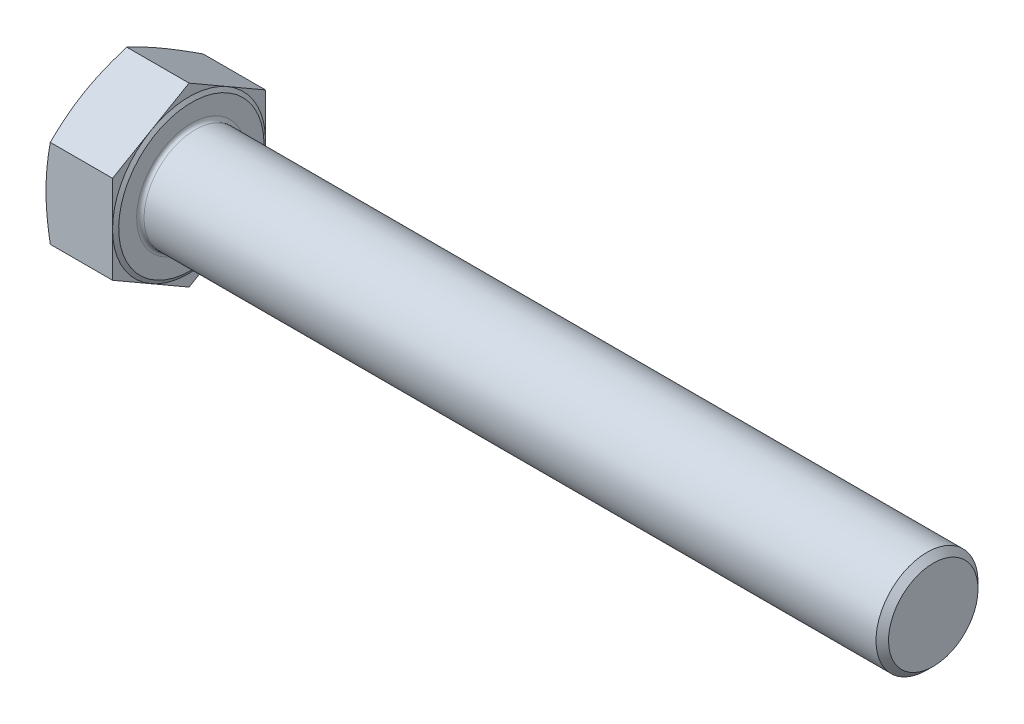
ISO-10303-21;
HEADER;
FILE_DESCRIPTION(('STEP AP214'),'2;1');
FILE_NAME('part.step','',(''),(''),'','','');
FILE_SCHEMA(('AUTOMOTIVE_DESIGN { 1 0 10303 214 1 1 1 1 }'));
ENDSEC;
DATA;
#1=APPLICATION_CONTEXT('core data for automotive mechanical design processes');
#2=APPLICATION_PROTOCOL_DEFINITION('international standard','automotive_design',2000,#1);
#3=PRODUCT_CONTEXT('',#1,'mechanical');
#4=PRODUCT('Part','Part','',(#3));
#5=PRODUCT_RELATED_PRODUCT_CATEGORY('part','',(#4));
#6=PRODUCT_DEFINITION_FORMATION('','',#4);
#7=PRODUCT_DEFINITION_CONTEXT('part definition',#1,'design');
#8=PRODUCT_DEFINITION('design','',#6,#7);
#9=PRODUCT_DEFINITION_SHAPE('','',#8);
#10=(LENGTH_UNIT() NAMED_UNIT(*) SI_UNIT(.MILLI.,.METRE.));
#11=(NAMED_UNIT(*) PLANE_ANGLE_UNIT() SI_UNIT($,.RADIAN.));
#12=(NAMED_UNIT(*) SI_UNIT($,.STERADIAN.) SOLID_ANGLE_UNIT());
#13=UNCERTAINTY_MEASURE_WITH_UNIT(LENGTH_MEASURE(1.E-05),#10,'distance_accuracy_value','');
#14=(GEOMETRIC_REPRESENTATION_CONTEXT(3) GLOBAL_UNCERTAINTY_ASSIGNED_CONTEXT((#13)) GLOBAL_UNIT_ASSIGNED_CONTEXT((#10,
#11,#12)) REPRESENTATION_CONTEXT('',''));
#15=CARTESIAN_POINT('',(0.,0.,0.));
#16=DIRECTION('',(0.,0.,1.));
#17=DIRECTION('',(1.,0.,0.));
#18=AXIS2_PLACEMENT_3D('',#15,#16,#17);
#19=CARTESIAN_POINT('',(14.85,0.,0.));
#20=DIRECTION('',(-1.,0.,0.));
#21=DIRECTION('',(0.,-1.,0.));
#22=AXIS2_PLACEMENT_3D('',#19,#20,#21);
#23=PLANE('',#22);
#24=CARTESIAN_POINT('',(14.85,0.,0.));
#25=DIRECTION('',(-1.,0.,0.));
#26=DIRECTION('',(0.,-1.,0.));
#27=AXIS2_PLACEMENT_3D('',#24,#25,#26);
#28=CIRCLE('',#27,11.8);
#29=CARTESIAN_POINT('',(14.85,-11.8,0.));
#30=VERTEX_POINT('',#29);
#31=EDGE_CURVE('E11',#30,#30,#28,.T.);
#32=ORIENTED_EDGE('',*,*,#31,.T.);
#33=EDGE_LOOP('',(#32));
#34=FACE_BOUND('',#33,.T.);
#35=CARTESIAN_POINT('',(14.85,0.,0.));
#36=DIRECTION('',(-1.,0.,0.));
#37=DIRECTION('',(0.,-1.,0.));
#38=AXIS2_PLACEMENT_3D('',#35,#36,#37);
#39=CIRCLE('',#38,15.675);
#40=CARTESIAN_POINT('',(14.85,-15.675,0.));
#41=VERTEX_POINT('',#40);
#42=EDGE_CURVE('E139',#41,#41,#39,.T.);
#43=ORIENTED_EDGE('',*,*,#42,.F.);
#44=EDGE_LOOP('',(#43));
#45=FACE_BOUND('',#44,.T.);
#46=ADVANCED_FACE('F32',(#34,#45),#23,.F.);
#47=CARTESIAN_POINT('',(14.35,-28.5788383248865,-16.5));
#48=DIRECTION('',(1.,0.,0.));
#49=DIRECTION('',(0.,0.,-1.));
#50=AXIS2_PLACEMENT_3D('',#47,#48,#49);
#51=PLANE('',#50);
#52=DIRECTION('',(0.,-0.5,-0.866025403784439));
#53=VECTOR('',#52,1.);
#54=CARTESIAN_POINT('',(14.35,-9.52627944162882,16.5));
#55=LINE('',#54,#53);
#56=CARTESIAN_POINT('',(14.35,-9.52627944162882,16.5));
#57=VERTEX_POINT('',#56);
#58=CARTESIAN_POINT('',(14.35,-14.2894191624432,8.25));
#59=VERTEX_POINT('',#58);
#60=EDGE_CURVE('E138',#57,#59,#55,.T.);
#61=ORIENTED_EDGE('',*,*,#60,.T.);
#62=CARTESIAN_POINT('',(14.35,0.,0.));
#63=DIRECTION('',(-1.,0.,0.));
#64=DIRECTION('',(0.,-1.,0.));
#65=AXIS2_PLACEMENT_3D('',#62,#63,#64);
#66=CIRCLE('',#65,16.5);
#67=CARTESIAN_POINT('',(14.35,0.,16.5));
#68=VERTEX_POINT('',#67);
#69=EDGE_CURVE('E48',#59,#68,#66,.T.);
#70=ORIENTED_EDGE('',*,*,#69,.T.);
#71=DIRECTION('',(0.,-1.,0.));
#72=VECTOR('',#71,1.);
#73=CARTESIAN_POINT('',(14.35,9.52627944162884,16.5));
#74=LINE('',#73,#72);
#75=EDGE_CURVE('E135',#68,#57,#74,.T.);
#76=ORIENTED_EDGE('',*,*,#75,.T.);
#77=EDGE_LOOP('',(#61,#70,#76));
#78=FACE_BOUND('',#77,.T.);
#79=ADVANCED_FACE('F134',(#78),#51,.T.);
#80=CARTESIAN_POINT('',(14.35,9.52627944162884,16.5));
#81=VERTEX_POINT('',#80);
#82=EDGE_CURVE('E146',#81,#68,#74,.T.);
#83=ORIENTED_EDGE('',*,*,#82,.T.);
#84=CARTESIAN_POINT('',(14.35,14.2894191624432,8.25));
#85=VERTEX_POINT('',#84);
#86=EDGE_CURVE('E121',#68,#85,#66,.T.);
#87=ORIENTED_EDGE('',*,*,#86,.T.);
#88=DIRECTION('',(0.,-0.5,0.866025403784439));
#89=VECTOR('',#88,1.);
#90=CARTESIAN_POINT('',(14.35,19.0525588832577,0.));
#91=LINE('',#90,#89);
#92=EDGE_CURVE('E152',#85,#81,#91,.T.);
#93=ORIENTED_EDGE('',*,*,#92,.T.);
#94=EDGE_LOOP('',(#83,#87,#93));
#95=FACE_BOUND('',#94,.T.);
#96=ADVANCED_FACE('F151',(#95),#51,.T.);
#97=CARTESIAN_POINT('',(14.35,19.0525588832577,0.));
#98=VERTEX_POINT('',#97);
#99=EDGE_CURVE('E149',#98,#85,#91,.T.);
#100=ORIENTED_EDGE('',*,*,#99,.T.);
#101=CARTESIAN_POINT('',(14.35,14.2894191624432,-8.25));
#102=VERTEX_POINT('',#101);
#103=EDGE_CURVE('E125',#85,#102,#66,.T.);
#104=ORIENTED_EDGE('',*,*,#103,.T.);
#105=DIRECTION('',(0.,0.5,0.866025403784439));
#106=VECTOR('',#105,1.);
#107=CARTESIAN_POINT('',(14.35,9.52627944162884,-16.5));
#108=LINE('',#107,#106);
#109=EDGE_CURVE('E308',#102,#98,#108,.T.);
#110=ORIENTED_EDGE('',*,*,#109,.T.);
#111=EDGE_LOOP('',(#100,#104,#110));
#112=FACE_BOUND('',#111,.T.);
#113=ADVANCED_FACE('F320',(#112),#51,.T.);
#114=CARTESIAN_POINT('',(14.35,9.52627944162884,-16.5));
#115=VERTEX_POINT('',#114);
#116=EDGE_CURVE('E310',#115,#102,#108,.T.);
#117=ORIENTED_EDGE('',*,*,#116,.T.);
#118=CARTESIAN_POINT('',(14.35,0.,-16.5));
#119=VERTEX_POINT('',#118);
#120=EDGE_CURVE('E364',#102,#119,#66,.T.);
#121=ORIENTED_EDGE('',*,*,#120,.T.);
#122=DIRECTION('',(0.,1.,0.));
#123=VECTOR('',#122,1.);
#124=CARTESIAN_POINT('',(14.35,-9.52627944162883,-16.5));
#125=LINE('',#124,#123);
#126=EDGE_CURVE('E305',#119,#115,#125,.T.);
#127=ORIENTED_EDGE('',*,*,#126,.T.);
#128=EDGE_LOOP('',(#117,#121,#127));
#129=FACE_BOUND('',#128,.T.);
#130=ADVANCED_FACE('F365',(#129),#51,.T.);
#131=CARTESIAN_POINT('',(14.35,-9.52627944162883,-16.5));
#132=VERTEX_POINT('',#131);
#133=EDGE_CURVE('E303',#132,#119,#125,.T.);
#134=ORIENTED_EDGE('',*,*,#133,.T.);
#135=CARTESIAN_POINT('',(14.35,-14.2894191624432,-8.24999999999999));
#136=VERTEX_POINT('',#135);
#137=EDGE_CURVE('E348',#119,#136,#66,.T.);
#138=ORIENTED_EDGE('',*,*,#137,.T.);
#139=DIRECTION('',(0.,0.5,-0.866025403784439));
#140=VECTOR('',#139,1.);
#141=CARTESIAN_POINT('',(14.35,-19.0525588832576,0.));
#142=LINE('',#141,#140);
#143=EDGE_CURVE('E362',#136,#132,#142,.T.);
#144=ORIENTED_EDGE('',*,*,#143,.T.);
#145=EDGE_LOOP('',(#134,#138,#144));
#146=FACE_BOUND('',#145,.T.);
#147=ADVANCED_FACE('F363',(#146),#51,.T.);
#148=CARTESIAN_POINT('',(14.35,-19.0525588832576,0.));
#149=VERTEX_POINT('',#148);
#150=EDGE_CURVE('E311',#149,#136,#142,.T.);
#151=ORIENTED_EDGE('',*,*,#150,.T.);
#152=EDGE_CURVE('E140',#136,#59,#66,.T.);
#153=ORIENTED_EDGE('',*,*,#152,.T.);
#154=EDGE_CURVE('E357',#59,#149,#55,.T.);
#155=ORIENTED_EDGE('',*,*,#154,.T.);
#156=EDGE_LOOP('',(#151,#153,#155));
#157=FACE_BOUND('',#156,.T.);
#158=ADVANCED_FACE('F206',(#157),#51,.T.);
#159=CARTESIAN_POINT('',(14.35,-9.52627944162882,16.5));
#160=DIRECTION('',(0.,0.866025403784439,-0.5));
#161=DIRECTION('',(0.,0.5,0.866025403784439));
#162=AXIS2_PLACEMENT_3D('',#159,#160,#161);
#163=PLANE('',#162);
#164=CARTESIAN_POINT('',(0.929097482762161,-19.0526743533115,-0.000199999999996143));
#165=CARTESIAN_POINT('',(0.857296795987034,-18.8553899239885,0.341506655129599));
#166=CARTESIAN_POINT('',(0.788725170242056,-18.6578155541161,0.683715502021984));
#167=CARTESIAN_POINT('',(0.65875039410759,-18.2620600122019,1.36918420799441));
#168=CARTESIAN_POINT('',(0.5973479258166,-18.0638787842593,1.71244416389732));
#169=CARTESIAN_POINT('',(0.424900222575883,-17.4681663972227,2.74424828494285));
#170=CARTESIAN_POINT('',(0.325715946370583,-17.0697392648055,3.43434432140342));
#171=CARTESIAN_POINT('',(0.205175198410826,-16.4725985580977,4.46862236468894));
#172=CARTESIAN_POINT('',(0.169803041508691,-16.2745739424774,4.81161106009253));
#173=CARTESIAN_POINT('',(0.108718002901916,-15.8781549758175,5.49822885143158));
#174=CARTESIAN_POINT('',(0.0830047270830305,-15.6797606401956,5.84185792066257));
#175=CARTESIAN_POINT('',(0.0416866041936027,-15.2827766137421,6.5294544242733));
#176=CARTESIAN_POINT('',(0.0260782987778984,-15.0841870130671,6.87342170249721));
#177=CARTESIAN_POINT('',(0.00523501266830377,-14.6868713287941,7.56159265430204));
#178=CARTESIAN_POINT('',(0.,-14.4881452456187,7.90579632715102));
#179=CARTESIAN_POINT('',(0.,-14.0906930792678,8.59420367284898));
#180=CARTESIAN_POINT('',(0.00523501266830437,-13.8919669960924,8.93840734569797));
#181=CARTESIAN_POINT('',(0.0260782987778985,-13.4946513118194,9.6265782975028));
#182=CARTESIAN_POINT('',(0.0416866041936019,-13.2960617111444,9.97054557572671));
#183=CARTESIAN_POINT('',(0.0830047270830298,-12.8990776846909,10.6581420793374));
#184=CARTESIAN_POINT('',(0.108718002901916,-12.700683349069,11.0017711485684));
#185=CARTESIAN_POINT('',(0.169803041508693,-12.304264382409,11.6883889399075));
#186=CARTESIAN_POINT('',(0.205175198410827,-12.1062397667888,12.0313776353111));
#187=CARTESIAN_POINT('',(0.325715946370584,-11.5090990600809,13.0656556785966));
#188=CARTESIAN_POINT('',(0.424900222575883,-11.1106719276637,13.7557517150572));
#189=CARTESIAN_POINT('',(0.5973479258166,-10.5149595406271,14.7875558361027));
#190=CARTESIAN_POINT('',(0.65875039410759,-10.3167783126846,15.1308157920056));
#191=CARTESIAN_POINT('',(0.788725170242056,-9.92102277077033,15.816284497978));
#192=CARTESIAN_POINT('',(0.857296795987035,-9.72344840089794,16.1584933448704));
#193=CARTESIAN_POINT('',(0.929097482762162,-9.52616397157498,16.5002));
#194=B_SPLINE_CURVE_WITH_KNOTS('',3,(#164,#165,#166,#167,#168,#169,#170,#171,#172,#173,#174,
#175,#176,#177,#178,#179,#180,#181,#182,#183,#184,#185,#186,#187,#188,#189,#190,#191,#192,#193),
.UNSPECIFIED.,.F.,.F.,(4,2,2,2,2,2,2,2,2,2,2,2,2,2,4),(0.,1.20310984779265,2.40633407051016,
4.8144458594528,6.00722883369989,7.19996313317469,8.39228901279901,9.58461121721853,
10.776933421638,11.9692593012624,13.1619936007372,14.3547765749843,16.7628883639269,
17.9661125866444,19.169222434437),.UNSPECIFIED.);
#195=CARTESIAN_POINT('',(0.92905545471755,-19.0525588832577,0.));
#196=VERTEX_POINT('',#195);
#197=CARTESIAN_POINT('',(0.,-14.2894191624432,8.24999999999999));
#198=VERTEX_POINT('',#197);
#199=EDGE_CURVE('E351',#196,#198,#194,.T.);
#200=ORIENTED_EDGE('',*,*,#199,.F.);
#201=DIRECTION('',(-1.,0.,0.));
#202=VECTOR('',#201,1.);
#203=CARTESIAN_POINT('',(14.35,-19.0525588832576,0.));
#204=LINE('',#203,#202);
#205=EDGE_CURVE('E169',#149,#196,#204,.T.);
#206=ORIENTED_EDGE('',*,*,#205,.F.);
#207=ORIENTED_EDGE('',*,*,#154,.F.);
#208=ORIENTED_EDGE('',*,*,#60,.F.);
#209=DIRECTION('',(-1.,0.,0.));
#210=VECTOR('',#209,1.);
#211=CARTESIAN_POINT('',(14.35,-9.52627944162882,16.5));
#212=LINE('',#211,#210);
#213=CARTESIAN_POINT('',(0.929055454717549,-9.52627944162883,16.5));
#214=VERTEX_POINT('',#213);
#215=EDGE_CURVE('E148',#57,#214,#212,.T.);
#216=ORIENTED_EDGE('',*,*,#215,.T.);
#217=EDGE_CURVE('E240',#198,#214,#194,.T.);
#218=ORIENTED_EDGE('',*,*,#217,.F.);
#219=EDGE_LOOP('',(#200,#206,#207,#208,#216,#218));
#220=FACE_BOUND('',#219,.T.);
#221=ADVANCED_FACE('F34',(#220),#163,.F.);
#222=CARTESIAN_POINT('',(14.35,-19.0525588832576,0.));
#223=DIRECTION('',(0.,0.866025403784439,0.5));
#224=DIRECTION('',(0.,-0.5,0.866025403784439));
#225=AXIS2_PLACEMENT_3D('',#222,#223,#224);
#226=PLANE('',#225);
#227=CARTESIAN_POINT('',(0.929097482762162,-9.52616397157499,-16.5002));
#228=CARTESIAN_POINT('',(0.857296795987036,-9.72344840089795,-16.1584933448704));
#229=CARTESIAN_POINT('',(0.788725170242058,-9.92102277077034,-15.816284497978));
#230=CARTESIAN_POINT('',(0.658750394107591,-10.3167783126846,-15.1308157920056));
#231=CARTESIAN_POINT('',(0.597347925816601,-10.5149595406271,-14.7875558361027));
#232=CARTESIAN_POINT('',(0.424900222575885,-11.1106719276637,-13.7557517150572));
#233=CARTESIAN_POINT('',(0.325715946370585,-11.5090990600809,-13.0656556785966));
#234=CARTESIAN_POINT('',(0.205175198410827,-12.1062397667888,-12.0313776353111));
#235=CARTESIAN_POINT('',(0.169803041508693,-12.304264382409,-11.6883889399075));
#236=CARTESIAN_POINT('',(0.108718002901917,-12.700683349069,-11.0017711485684));
#237=CARTESIAN_POINT('',(0.0830047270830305,-12.8990776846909,-10.6581420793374));
#238=CARTESIAN_POINT('',(0.0416866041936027,-13.2960617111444,-9.97054557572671));
#239=CARTESIAN_POINT('',(0.0260782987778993,-13.4946513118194,-9.62657829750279));
#240=CARTESIAN_POINT('',(0.00523501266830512,-13.8919669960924,-8.93840734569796));
#241=CARTESIAN_POINT('',(0.,-14.0906930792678,-8.59420367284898));
#242=CARTESIAN_POINT('',(0.,-14.4881452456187,-7.90579632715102));
#243=CARTESIAN_POINT('',(0.00523501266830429,-14.6868713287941,-7.56159265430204));
#244=CARTESIAN_POINT('',(0.0260782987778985,-15.0841870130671,-6.87342170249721));
#245=CARTESIAN_POINT('',(0.0416866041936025,-15.2827766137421,-6.52945442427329));
#246=CARTESIAN_POINT('',(0.0830047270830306,-15.6797606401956,-5.84185792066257));
#247=CARTESIAN_POINT('',(0.108718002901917,-15.8781549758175,-5.49822885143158));
#248=CARTESIAN_POINT('',(0.169803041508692,-16.2745739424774,-4.81161106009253));
#249=CARTESIAN_POINT('',(0.205175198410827,-16.4725985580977,-4.46862236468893));
#250=CARTESIAN_POINT('',(0.325715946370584,-17.0697392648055,-3.43434432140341));
#251=CARTESIAN_POINT('',(0.424900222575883,-17.4681663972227,-2.74424828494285));
#252=CARTESIAN_POINT('',(0.5973479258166,-18.0638787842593,-1.71244416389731));
#253=CARTESIAN_POINT('',(0.65875039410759,-18.2620600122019,-1.3691842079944));
#254=CARTESIAN_POINT('',(0.788725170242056,-18.6578155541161,-0.683715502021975));
#255=CARTESIAN_POINT('',(0.857296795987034,-18.8553899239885,-0.341506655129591));
#256=CARTESIAN_POINT('',(0.929097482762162,-19.0526743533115,0.000200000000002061));
#257=B_SPLINE_CURVE_WITH_KNOTS('',3,(#227,#228,#229,#230,#231,#232,#233,#234,#235,#236,#237,
#238,#239,#240,#241,#242,#243,#244,#245,#246,#247,#248,#249,#250,#251,#252,#253,#254,#255,#256),
.UNSPECIFIED.,.F.,.F.,(4,2,2,2,2,2,2,2,2,2,2,2,2,2,4),(0.,1.20310984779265,2.40633407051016,
4.8144458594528,6.00722883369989,7.19996313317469,8.39228901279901,9.58461121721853,
10.776933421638,11.9692593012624,13.1619936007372,14.3547765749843,16.7628883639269,
17.9661125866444,19.1692224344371),.UNSPECIFIED.);
#258=CARTESIAN_POINT('',(0.929055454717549,-9.52627944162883,-16.5));
#259=VERTEX_POINT('',#258);
#260=CARTESIAN_POINT('',(0.,-14.2894191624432,-8.24999999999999));
#261=VERTEX_POINT('',#260);
#262=EDGE_CURVE('E254',#259,#261,#257,.T.);
#263=ORIENTED_EDGE('',*,*,#262,.F.);
#264=DIRECTION('',(-1.,0.,0.));
#265=VECTOR('',#264,1.);
#266=CARTESIAN_POINT('',(14.35,-9.52627944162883,-16.5));
#267=LINE('',#266,#265);
#268=EDGE_CURVE('E166',#132,#259,#267,.T.);
#269=ORIENTED_EDGE('',*,*,#268,.F.);
#270=ORIENTED_EDGE('',*,*,#143,.F.);
#271=ORIENTED_EDGE('',*,*,#150,.F.);
#272=ORIENTED_EDGE('',*,*,#205,.T.);
#273=EDGE_CURVE('E250',#261,#196,#257,.T.);
#274=ORIENTED_EDGE('',*,*,#273,.F.);
#275=EDGE_LOOP('',(#263,#269,#270,#271,#272,#274));
#276=FACE_BOUND('',#275,.T.);
#277=ADVANCED_FACE('F261',(#276),#226,.F.);
#278=CARTESIAN_POINT('',(14.35,-9.52627944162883,-16.5));
#279=DIRECTION('',(0.,0.,1.));
#280=DIRECTION('',(1.,0.,0.));
#281=AXIS2_PLACEMENT_3D('',#278,#279,#280);
#282=PLANE('',#281);
#283=CARTESIAN_POINT('',(4.96450390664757,-25.2222382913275,-16.5));
#284=CARTESIAN_POINT('',(4.85081864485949,-24.8489839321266,-16.5));
#285=CARTESIAN_POINT('',(4.73782089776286,-24.4755202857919,-16.5));
#286=CARTESIAN_POINT('',(4.51335434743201,-23.7281315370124,-16.5));
#287=CARTESIAN_POINT('',(4.40188555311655,-23.3542064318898,-16.5));
#288=CARTESIAN_POINT('',(4.06998909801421,-22.2316258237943,-16.5));
#289=CARTESIAN_POINT('',(3.85208821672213,-21.4822201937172,-16.5));
#290=CARTESIAN_POINT('',(3.42417782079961,-19.9796417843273,-16.5));
#291=CARTESIAN_POINT('',(3.21418378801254,-19.2264645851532,-16.5));
#292=CARTESIAN_POINT('',(2.80452755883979,-17.7173088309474,-16.5));
#293=CARTESIAN_POINT('',(2.60486517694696,-16.961330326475,-16.5));
#294=CARTESIAN_POINT('',(2.22081902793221,-15.4554094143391,-16.5));
#295=CARTESIAN_POINT('',(2.0362772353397,-14.7055075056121,-16.5));
#296=CARTESIAN_POINT('',(1.68290492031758,-13.201972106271,-16.5));
#297=CARTESIAN_POINT('',(1.51407466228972,-12.4483385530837,-16.5));
#298=CARTESIAN_POINT('',(1.19606187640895,-10.9371711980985,-16.5));
#299=CARTESIAN_POINT('',(1.04687264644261,-10.1796388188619,-16.5));
#300=CARTESIAN_POINT('',(0.77268459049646,-8.66017606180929,-16.5));
#301=CARTESIAN_POINT('',(0.647684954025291,-7.89824583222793,-16.5));
#302=CARTESIAN_POINT('',(0.439330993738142,-6.45578370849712,-16.5));
#303=CARTESIAN_POINT('',(0.352878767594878,-5.77570349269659,-16.5));
#304=CARTESIAN_POINT('',(0.206535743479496,-4.41266734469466,-16.5));
#305=CARTESIAN_POINT('',(0.14664417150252,-3.72971149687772,-16.5));
#306=CARTESIAN_POINT('',(0.0563067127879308,-2.36230937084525,-16.5));
#307=CARTESIAN_POINT('',(0.0258399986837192,-1.67786449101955,-16.5));
#308=CARTESIAN_POINT('',(-0.00410522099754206,-0.308289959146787,-16.5));
#309=CARTESIAN_POINT('',(-0.0035839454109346,0.376839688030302,-16.5));
#310=CARTESIAN_POINT('',(0.0284996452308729,1.74983625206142,-16.5));
#311=CARTESIAN_POINT('',(0.0602193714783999,2.43769942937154,-16.5));
#312=CARTESIAN_POINT('',(0.153240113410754,3.81140535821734,-16.5));
#313=CARTESIAN_POINT('',(0.214541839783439,4.49724806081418,-16.5));
#314=CARTESIAN_POINT('',(0.363858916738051,5.86657438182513,-16.5));
#315=CARTESIAN_POINT('',(0.451897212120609,6.55005546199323,-16.5));
#316=CARTESIAN_POINT('',(0.651116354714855,7.91359833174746,-16.5));
#317=CARTESIAN_POINT('',(0.762297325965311,8.59366010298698,-16.5));
#318=CARTESIAN_POINT('',(1.01058110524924,9.98615039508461,-16.5));
#319=CARTESIAN_POINT('',(1.1487439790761,10.6983882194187,-16.5));
#320=CARTESIAN_POINT('',(1.4428521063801,12.1192063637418,-16.5));
#321=CARTESIAN_POINT('',(1.59879870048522,12.8277864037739,-16.5));
#322=CARTESIAN_POINT('',(1.92519971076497,14.2417939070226,-16.5));
#323=CARTESIAN_POINT('',(2.09565834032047,14.9472203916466,-16.5));
#324=CARTESIAN_POINT('',(2.44831056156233,16.3551017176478,-16.5));
#325=CARTESIAN_POINT('',(2.63050387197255,17.0575566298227,-16.5));
#326=CARTESIAN_POINT('',(3.00467207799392,18.4608135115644,-16.5));
#327=CARTESIAN_POINT('',(3.19665923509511,19.1616121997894,-16.5));
#328=CARTESIAN_POINT('',(3.58844340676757,20.5610201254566,-16.5));
#329=CARTESIAN_POINT('',(3.78824045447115,21.2596293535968,-16.5));
#330=CARTESIAN_POINT('',(4.19421484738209,22.6548603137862,-16.5));
#331=CARTESIAN_POINT('',(4.40039111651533,23.3514823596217,-16.5));
#332=CARTESIAN_POINT('',(4.818047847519,24.7431302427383,-16.5));
#333=CARTESIAN_POINT('',(5.02952829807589,25.4381560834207,-16.5));
#334=CARTESIAN_POINT('',(5.45454897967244,26.8191789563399,-16.5));
#335=CARTESIAN_POINT('',(5.66804068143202,27.5051909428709,-16.5));
#336=CARTESIAN_POINT('',(6.09866542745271,28.8760718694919,-16.5));
#337=CARTESIAN_POINT('',(6.31579848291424,29.5609408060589,-16.5));
#338=CARTESIAN_POINT('',(6.9718145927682,31.6141379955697,-16.5));
#339=CARTESIAN_POINT('',(7.41529632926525,32.980997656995,-16.5));
#340=CARTESIAN_POINT('',(8.08638638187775,35.0264823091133,-16.5));
#341=CARTESIAN_POINT('',(8.31062765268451,35.706217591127,-16.5));
#342=CARTESIAN_POINT('',(8.76104960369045,37.0650463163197,-16.5));
#343=CARTESIAN_POINT('',(8.98723028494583,37.744139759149,-16.5));
#344=CARTESIAN_POINT('',(9.44125199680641,39.1017090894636,-16.5));
#345=CARTESIAN_POINT('',(9.66909288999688,39.7801850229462,-16.5));
#346=CARTESIAN_POINT('',(10.1262489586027,41.1366382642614,-16.5));
#347=CARTESIAN_POINT('',(10.3555641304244,41.8146155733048,-16.5));
#348=CARTESIAN_POINT('',(10.5855148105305,42.492376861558,-16.5));
#349=B_SPLINE_CURVE_WITH_KNOTS('',3,(#283,#284,#285,#286,#287,#288,#289,#290,#291,#292,#293,
#294,#295,#296,#297,#298,#299,#300,#301,#302,#303,#304,#305,#306,#307,#308,#309,#310,#311,#312,
#313,#314,#315,#316,#317,#318,#319,#320,#321,#322,#323,#324,#325,#326,#327,#328,#329,#330,#331,
#332,#333,#334,#335,#336,#337,#338,#339,#340,#341,#342,#343,#344,#345,#346,#347,#348),
.UNSPECIFIED.,.F.,.F.,(4,2,2,2,2,2,2,2,2,2,2,2,2,2,2,2,2,2,2,2,2,2,2,2,2,2,2,2,2,2,2,2,4),(0.,
1.17054922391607,2.34110527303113,4.68239041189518,7.02804380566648,9.37365506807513,
11.6903461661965,14.0070762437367,16.3230137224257,18.6388735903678,20.6950814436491,
22.7512293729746,24.8059208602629,26.8605978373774,28.9256951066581,30.9908419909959,
33.0577661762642,35.124701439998,37.3009674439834,39.4773976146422,41.6544618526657,
43.8314739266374,46.0112818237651,48.1910989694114,50.3705503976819,52.5499971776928,
54.7053784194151,56.8607662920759,61.1717272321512,63.3190307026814,65.4663353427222,
67.6134642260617,69.760587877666),.UNSPECIFIED.);
#350=CARTESIAN_POINT('',(0.929055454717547,9.52627944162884,-16.5));
#351=VERTEX_POINT('',#350);
#352=CARTESIAN_POINT('',(0.,0.,-16.5));
#353=VERTEX_POINT('',#352);
#354=EDGE_CURVE('E295',#351,#353,#349,.F.);
#355=ORIENTED_EDGE('',*,*,#354,.F.);
#356=DIRECTION('',(-1.,0.,0.));
#357=VECTOR('',#356,1.);
#358=CARTESIAN_POINT('',(14.35,9.52627944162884,-16.5));
#359=LINE('',#358,#357);
#360=EDGE_CURVE('E163',#115,#351,#359,.T.);
#361=ORIENTED_EDGE('',*,*,#360,.F.);
#362=ORIENTED_EDGE('',*,*,#126,.F.);
#363=ORIENTED_EDGE('',*,*,#133,.F.);
#364=ORIENTED_EDGE('',*,*,#268,.T.);
#365=EDGE_CURVE('E255',#353,#259,#349,.F.);
#366=ORIENTED_EDGE('',*,*,#365,.F.);
#367=EDGE_LOOP('',(#355,#361,#362,#363,#364,#366));
#368=FACE_BOUND('',#367,.T.);
#369=ADVANCED_FACE('F264',(#368),#282,.F.);
#370=CARTESIAN_POINT('',(14.35,9.52627944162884,-16.5));
#371=DIRECTION('',(0.,-0.866025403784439,0.5));
#372=DIRECTION('',(0.,-0.5,-0.866025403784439));
#373=AXIS2_PLACEMENT_3D('',#370,#371,#372);
#374=PLANE('',#373);
#375=CARTESIAN_POINT('',(0.92909748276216,19.0526743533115,0.000199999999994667));
#376=CARTESIAN_POINT('',(0.857296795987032,18.8553899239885,-0.3415066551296));
#377=CARTESIAN_POINT('',(0.788725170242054,18.6578155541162,-0.683715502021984));
#378=CARTESIAN_POINT('',(0.658750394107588,18.2620600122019,-1.36918420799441));
#379=CARTESIAN_POINT('',(0.597347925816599,18.0638787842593,-1.71244416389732));
#380=CARTESIAN_POINT('',(0.424900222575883,17.4681663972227,-2.74424828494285));
#381=CARTESIAN_POINT('',(0.325715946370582,17.0697392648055,-3.43434432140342));
#382=CARTESIAN_POINT('',(0.205175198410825,16.4725985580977,-4.46862236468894));
#383=CARTESIAN_POINT('',(0.169803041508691,16.2745739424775,-4.81161106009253));
#384=CARTESIAN_POINT('',(0.108718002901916,15.8781549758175,-5.49822885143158));
#385=CARTESIAN_POINT('',(0.0830047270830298,15.6797606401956,-5.84185792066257));
#386=CARTESIAN_POINT('',(0.0416866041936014,15.2827766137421,-6.52945442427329));
#387=CARTESIAN_POINT('',(0.026078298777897,15.0841870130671,-6.87342170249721));
#388=CARTESIAN_POINT('',(0.00523501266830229,14.6868713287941,-7.56159265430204));
#389=CARTESIAN_POINT('',(0.,14.4881452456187,-7.90579632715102));
#390=CARTESIAN_POINT('',(0.,14.0906930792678,-8.59420367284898));
#391=CARTESIAN_POINT('',(0.00523501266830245,13.8919669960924,-8.93840734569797));
#392=CARTESIAN_POINT('',(0.0260782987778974,13.4946513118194,-9.62657829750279));
#393=CARTESIAN_POINT('',(0.041686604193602,13.2960617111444,-9.97054557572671));
#394=CARTESIAN_POINT('',(0.0830047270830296,12.8990776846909,-10.6581420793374));
#395=CARTESIAN_POINT('',(0.108718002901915,12.700683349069,-11.0017711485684));
#396=CARTESIAN_POINT('',(0.16980304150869,12.304264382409,-11.6883889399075));
#397=CARTESIAN_POINT('',(0.205175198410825,12.1062397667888,-12.0313776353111));
#398=CARTESIAN_POINT('',(0.325715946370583,11.509099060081,-13.0656556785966));
#399=CARTESIAN_POINT('',(0.424900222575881,11.1106719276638,-13.7557517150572));
#400=CARTESIAN_POINT('',(0.597347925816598,10.5149595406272,-14.7875558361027));
#401=CARTESIAN_POINT('',(0.658750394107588,10.3167783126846,-15.1308157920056));
#402=CARTESIAN_POINT('',(0.788725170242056,9.92102277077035,-15.816284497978));
#403=CARTESIAN_POINT('',(0.857296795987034,9.72344840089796,-16.1584933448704));
#404=CARTESIAN_POINT('',(0.929097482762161,9.526163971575,-16.5002));
#405=B_SPLINE_CURVE_WITH_KNOTS('',3,(#375,#376,#377,#378,#379,#380,#381,#382,#383,#384,#385,
#386,#387,#388,#389,#390,#391,#392,#393,#394,#395,#396,#397,#398,#399,#400,#401,#402,#403,#404),
.UNSPECIFIED.,.F.,.F.,(4,2,2,2,2,2,2,2,2,2,2,2,2,2,4),(0.,1.20310984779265,2.40633407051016,
4.8144458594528,6.00722883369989,7.19996313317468,8.39228901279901,9.58461121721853,
10.776933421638,11.9692593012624,13.1619936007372,14.3547765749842,16.7628883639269,
17.9661125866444,19.1692224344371),.UNSPECIFIED.);
#406=CARTESIAN_POINT('',(0.929055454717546,19.0525588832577,0.));
#407=VERTEX_POINT('',#406);
#408=CARTESIAN_POINT('',(0.,14.2894191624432,-8.25));
#409=VERTEX_POINT('',#408);
#410=EDGE_CURVE('E56',#407,#409,#405,.T.);
#411=ORIENTED_EDGE('',*,*,#410,.F.);
#412=DIRECTION('',(-1.,0.,0.));
#413=VECTOR('',#412,1.);
#414=CARTESIAN_POINT('',(14.35,19.0525588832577,0.));
#415=LINE('',#414,#413);
#416=EDGE_CURVE('E160',#98,#407,#415,.T.);
#417=ORIENTED_EDGE('',*,*,#416,.F.);
#418=ORIENTED_EDGE('',*,*,#109,.F.);
#419=ORIENTED_EDGE('',*,*,#116,.F.);
#420=ORIENTED_EDGE('',*,*,#360,.T.);
#421=EDGE_CURVE('E296',#409,#351,#405,.T.);
#422=ORIENTED_EDGE('',*,*,#421,.F.);
#423=EDGE_LOOP('',(#411,#417,#418,#419,#420,#422));
#424=FACE_BOUND('',#423,.T.);
#425=ADVANCED_FACE('F268',(#424),#374,.F.);
#426=CARTESIAN_POINT('',(14.35,19.0525588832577,0.));
#427=DIRECTION('',(0.,-0.866025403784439,-0.5));
#428=DIRECTION('',(0.,0.5,-0.866025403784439));
#429=AXIS2_PLACEMENT_3D('',#426,#427,#428);
#430=PLANE('',#429);
#431=CARTESIAN_POINT('',(0.92909748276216,9.526163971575,16.5002));
#432=CARTESIAN_POINT('',(0.857296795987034,9.72344840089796,16.1584933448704));
#433=CARTESIAN_POINT('',(0.788725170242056,9.92102277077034,15.816284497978));
#434=CARTESIAN_POINT('',(0.658750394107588,10.3167783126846,15.1308157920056));
#435=CARTESIAN_POINT('',(0.597347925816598,10.5149595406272,14.7875558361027));
#436=CARTESIAN_POINT('',(0.42490022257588,11.1106719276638,13.7557517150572));
#437=CARTESIAN_POINT('',(0.325715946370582,11.509099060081,13.0656556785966));
#438=CARTESIAN_POINT('',(0.205175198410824,12.1062397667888,12.0313776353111));
#439=CARTESIAN_POINT('',(0.169803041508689,12.304264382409,11.6883889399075));
#440=CARTESIAN_POINT('',(0.108718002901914,12.700683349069,11.0017711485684));
#441=CARTESIAN_POINT('',(0.0830047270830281,12.8990776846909,10.6581420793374));
#442=CARTESIAN_POINT('',(0.0416866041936,13.2960617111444,9.97054557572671));
#443=CARTESIAN_POINT('',(0.0260782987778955,13.4946513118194,9.62657829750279));
#444=CARTESIAN_POINT('',(0.00523501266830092,13.8919669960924,8.93840734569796));
#445=CARTESIAN_POINT('',(0.,14.0906930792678,8.59420367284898));
#446=CARTESIAN_POINT('',(0.,14.4881452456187,7.90579632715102));
#447=CARTESIAN_POINT('',(0.00523501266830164,14.6868713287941,7.56159265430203));
#448=CARTESIAN_POINT('',(0.0260782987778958,15.0841870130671,6.87342170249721));
#449=CARTESIAN_POINT('',(0.0416866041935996,15.2827766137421,6.52945442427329));
#450=CARTESIAN_POINT('',(0.0830047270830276,15.6797606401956,5.84185792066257));
#451=CARTESIAN_POINT('',(0.108718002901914,15.8781549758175,5.49822885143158));
#452=CARTESIAN_POINT('',(0.16980304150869,16.2745739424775,4.81161106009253));
#453=CARTESIAN_POINT('',(0.205175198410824,16.4725985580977,4.46862236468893));
#454=CARTESIAN_POINT('',(0.325715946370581,17.0697392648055,3.43434432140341));
#455=CARTESIAN_POINT('',(0.424900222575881,17.4681663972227,2.74424828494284));
#456=CARTESIAN_POINT('',(0.597347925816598,18.0638787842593,1.71244416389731));
#457=CARTESIAN_POINT('',(0.658750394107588,18.2620600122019,1.3691842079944));
#458=CARTESIAN_POINT('',(0.788725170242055,18.6578155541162,0.683715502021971));
#459=CARTESIAN_POINT('',(0.857296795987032,18.8553899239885,0.341506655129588));
#460=CARTESIAN_POINT('',(0.92909748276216,19.0526743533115,-0.00020000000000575));
#461=B_SPLINE_CURVE_WITH_KNOTS('',3,(#431,#432,#433,#434,#435,#436,#437,#438,#439,#440,#441,
#442,#443,#444,#445,#446,#447,#448,#449,#450,#451,#452,#453,#454,#455,#456,#457,#458,#459,#460),
.UNSPECIFIED.,.F.,.F.,(4,2,2,2,2,2,2,2,2,2,2,2,2,2,4),(0.,1.20310984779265,2.40633407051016,
4.81444585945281,6.00722883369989,7.19996313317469,8.39228901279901,9.58461121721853,
10.7769334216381,11.9692593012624,13.1619936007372,14.3547765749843,16.7628883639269,
17.9661125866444,19.1692224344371),.UNSPECIFIED.);
#462=CARTESIAN_POINT('',(0.929055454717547,9.52627944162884,16.5));
#463=VERTEX_POINT('',#462);
#464=CARTESIAN_POINT('',(0.,14.2894191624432,8.24999999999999));
#465=VERTEX_POINT('',#464);
#466=EDGE_CURVE('E233',#463,#465,#461,.T.);
#467=ORIENTED_EDGE('',*,*,#466,.F.);
#468=DIRECTION('',(-1.,0.,0.));
#469=VECTOR('',#468,1.);
#470=CARTESIAN_POINT('',(14.35,9.52627944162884,16.5));
#471=LINE('',#470,#469);
#472=EDGE_CURVE('E154',#81,#463,#471,.T.);
#473=ORIENTED_EDGE('',*,*,#472,.F.);
#474=ORIENTED_EDGE('',*,*,#92,.F.);
#475=ORIENTED_EDGE('',*,*,#99,.F.);
#476=ORIENTED_EDGE('',*,*,#416,.T.);
#477=EDGE_CURVE('E356',#465,#407,#461,.T.);
#478=ORIENTED_EDGE('',*,*,#477,.F.);
#479=EDGE_LOOP('',(#467,#473,#474,#475,#476,#478));
#480=FACE_BOUND('',#479,.T.);
#481=ADVANCED_FACE('F272',(#480),#430,.F.);
#482=CARTESIAN_POINT('',(14.35,9.52627944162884,16.5));
#483=DIRECTION('',(0.,0.,-1.));
#484=DIRECTION('',(-1.,0.,0.));
#485=AXIS2_PLACEMENT_3D('',#482,#483,#484);
#486=PLANE('',#485);
#487=CARTESIAN_POINT('',(4.96450390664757,-25.2222382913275,16.5));
#488=CARTESIAN_POINT('',(4.85081864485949,-24.8489839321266,16.5));
#489=CARTESIAN_POINT('',(4.73782089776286,-24.4755202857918,16.5));
#490=CARTESIAN_POINT('',(4.51335434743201,-23.7281315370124,16.5));
#491=CARTESIAN_POINT('',(4.40188555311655,-23.3542064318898,16.5));
#492=CARTESIAN_POINT('',(4.06998909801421,-22.2316258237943,16.5));
#493=CARTESIAN_POINT('',(3.85208821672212,-21.4822201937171,16.5));
#494=CARTESIAN_POINT('',(3.4241778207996,-19.9796417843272,16.5));
#495=CARTESIAN_POINT('',(3.21418378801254,-19.2264645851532,16.5));
#496=CARTESIAN_POINT('',(2.80452755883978,-17.7173088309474,16.5));
#497=CARTESIAN_POINT('',(2.60486517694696,-16.961330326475,16.5));
#498=CARTESIAN_POINT('',(2.22081902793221,-15.4554094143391,16.5));
#499=CARTESIAN_POINT('',(2.0362772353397,-14.7055075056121,16.5));
#500=CARTESIAN_POINT('',(1.68290492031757,-13.201972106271,16.5));
#501=CARTESIAN_POINT('',(1.51407466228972,-12.4483385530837,16.5));
#502=CARTESIAN_POINT('',(1.19606187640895,-10.9371711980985,16.5));
#503=CARTESIAN_POINT('',(1.04687264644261,-10.1796388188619,16.5));
#504=CARTESIAN_POINT('',(0.772684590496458,-8.66017606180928,16.5));
#505=CARTESIAN_POINT('',(0.64768495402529,-7.89824583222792,16.5));
#506=CARTESIAN_POINT('',(0.439330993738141,-6.45578370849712,16.5));
#507=CARTESIAN_POINT('',(0.352878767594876,-5.77570349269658,16.5));
#508=CARTESIAN_POINT('',(0.206535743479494,-4.41266734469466,16.5));
#509=CARTESIAN_POINT('',(0.146644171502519,-3.72971149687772,16.5));
#510=CARTESIAN_POINT('',(0.0563067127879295,-2.36230937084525,16.5));
#511=CARTESIAN_POINT('',(0.0258399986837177,-1.67786449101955,16.5));
#512=CARTESIAN_POINT('',(-0.00410522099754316,-0.30828995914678,16.5));
#513=CARTESIAN_POINT('',(-0.00358394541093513,0.37683968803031,16.5));
#514=CARTESIAN_POINT('',(0.0284996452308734,1.74983625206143,16.5));
#515=CARTESIAN_POINT('',(0.0602193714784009,2.43769942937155,16.5));
#516=CARTESIAN_POINT('',(0.153240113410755,3.81140535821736,16.5));
#517=CARTESIAN_POINT('',(0.21454183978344,4.49724806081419,16.5));
#518=CARTESIAN_POINT('',(0.363858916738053,5.86657438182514,16.5));
#519=CARTESIAN_POINT('',(0.45189721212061,6.55005546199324,16.5));
#520=CARTESIAN_POINT('',(0.651116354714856,7.91359833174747,16.5));
#521=CARTESIAN_POINT('',(0.762297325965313,8.59366010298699,16.5));
#522=CARTESIAN_POINT('',(1.01058110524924,9.98615039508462,16.5));
#523=CARTESIAN_POINT('',(1.1487439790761,10.6983882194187,16.5));
#524=CARTESIAN_POINT('',(1.4428521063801,12.1192063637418,16.5));
#525=CARTESIAN_POINT('',(1.59879870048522,12.8277864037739,16.5));
#526=CARTESIAN_POINT('',(1.92519971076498,14.2417939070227,16.5));
#527=CARTESIAN_POINT('',(2.09565834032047,14.9472203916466,16.5));
#528=CARTESIAN_POINT('',(2.44831056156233,16.3551017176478,16.5));
#529=CARTESIAN_POINT('',(2.63050387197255,17.0575566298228,16.5));
#530=CARTESIAN_POINT('',(3.00467207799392,18.4608135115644,16.5));
#531=CARTESIAN_POINT('',(3.19665923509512,19.1616121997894,16.5));
#532=CARTESIAN_POINT('',(3.58844340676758,20.5610201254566,16.5));
#533=CARTESIAN_POINT('',(3.78824045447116,21.2596293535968,16.5));
#534=CARTESIAN_POINT('',(4.19421484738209,22.6548603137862,16.5));
#535=CARTESIAN_POINT('',(4.40039111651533,23.3514823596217,16.5));
#536=CARTESIAN_POINT('',(4.818047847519,24.7431302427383,16.5));
#537=CARTESIAN_POINT('',(5.0295282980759,25.4381560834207,16.5));
#538=CARTESIAN_POINT('',(5.45454897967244,26.8191789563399,16.5));
#539=CARTESIAN_POINT('',(5.66804068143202,27.5051909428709,16.5));
#540=CARTESIAN_POINT('',(6.09866542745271,28.8760718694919,16.5));
#541=CARTESIAN_POINT('',(6.31579848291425,29.5609408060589,16.5));
#542=CARTESIAN_POINT('',(6.97181459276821,31.6141379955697,16.5));
#543=CARTESIAN_POINT('',(7.41529632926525,32.980997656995,16.5));
#544=CARTESIAN_POINT('',(8.08638638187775,35.0264823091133,16.5));
#545=CARTESIAN_POINT('',(8.31062765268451,35.706217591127,16.5));
#546=CARTESIAN_POINT('',(8.76104960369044,37.0650463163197,16.5));
#547=CARTESIAN_POINT('',(8.98723028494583,37.744139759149,16.5));
#548=CARTESIAN_POINT('',(9.44125199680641,39.1017090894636,16.5));
#549=CARTESIAN_POINT('',(9.66909288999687,39.7801850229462,16.5));
#550=CARTESIAN_POINT('',(10.1262489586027,41.1366382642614,16.5));
#551=CARTESIAN_POINT('',(10.3555641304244,41.8146155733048,16.5));
#552=CARTESIAN_POINT('',(10.5855148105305,42.4923768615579,16.5));
#553=B_SPLINE_CURVE_WITH_KNOTS('',3,(#487,#488,#489,#490,#491,#492,#493,#494,#495,#496,#497,
#498,#499,#500,#501,#502,#503,#504,#505,#506,#507,#508,#509,#510,#511,#512,#513,#514,#515,#516,
#517,#518,#519,#520,#521,#522,#523,#524,#525,#526,#527,#528,#529,#530,#531,#532,#533,#534,#535,
#536,#537,#538,#539,#540,#541,#542,#543,#544,#545,#546,#547,#548,#549,#550,#551,#552),
.UNSPECIFIED.,.F.,.F.,(4,2,2,2,2,2,2,2,2,2,2,2,2,2,2,2,2,2,2,2,2,2,2,2,2,2,2,2,2,2,2,2,4),(0.,
1.17054922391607,2.34110527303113,4.68239041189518,7.02804380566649,9.37365506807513,
11.6903461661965,14.0070762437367,16.3230137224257,18.6388735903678,20.6950814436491,
22.7512293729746,24.8059208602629,26.8605978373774,28.9256951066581,30.9908419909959,
33.0577661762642,35.124701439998,37.3009674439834,39.4773976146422,41.6544618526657,
43.8314739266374,46.0112818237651,48.1910989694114,50.3705503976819,52.5499971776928,
54.7053784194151,56.8607662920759,61.1717272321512,63.3190307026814,65.4663353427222,
67.6134642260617,69.7605878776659),.UNSPECIFIED.);
#554=CARTESIAN_POINT('',(0.,0.,16.5));
#555=VERTEX_POINT('',#554);
#556=EDGE_CURVE('E327',#214,#555,#553,.T.);
#557=ORIENTED_EDGE('',*,*,#556,.F.);
#558=ORIENTED_EDGE('',*,*,#215,.F.);
#559=ORIENTED_EDGE('',*,*,#75,.F.);
#560=ORIENTED_EDGE('',*,*,#82,.F.);
#561=ORIENTED_EDGE('',*,*,#472,.T.);
#562=EDGE_CURVE('E223',#555,#463,#553,.T.);
#563=ORIENTED_EDGE('',*,*,#562,.F.);
#564=EDGE_LOOP('',(#557,#558,#559,#560,#561,#563));
#565=FACE_BOUND('',#564,.T.);
#566=ADVANCED_FACE('F144',(#565),#486,.F.);
#567=CARTESIAN_POINT('',(0.,0.,0.));
#568=DIRECTION('',(1.,0.,0.));
#569=DIRECTION('',(0.,1.,0.));
#570=AXIS2_PLACEMENT_3D('',#567,#568,#569);
#571=CONICAL_SURFACE('',#570,16.5,1.22173047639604);
#572=ORIENTED_EDGE('',*,*,#365,.T.);
#573=ORIENTED_EDGE('',*,*,#262,.T.);
#574=CARTESIAN_POINT('',(0.,0.,0.));
#575=DIRECTION('',(1.,0.,0.));
#576=DIRECTION('',(0.,0.,-1.));
#577=AXIS2_PLACEMENT_3D('',#574,#575,#576);
#578=CIRCLE('',#577,16.5);
#579=EDGE_CURVE('E172',#261,#353,#578,.T.);
#580=ORIENTED_EDGE('',*,*,#579,.T.);
#581=EDGE_LOOP('',(#572,#573,#580));
#582=FACE_BOUND('',#581,.T.);
#583=ADVANCED_FACE('F218',(#582),#571,.T.);
#584=ORIENTED_EDGE('',*,*,#273,.T.);
#585=ORIENTED_EDGE('',*,*,#199,.T.);
#586=EDGE_CURVE('E175',#198,#261,#578,.T.);
#587=ORIENTED_EDGE('',*,*,#586,.T.);
#588=EDGE_LOOP('',(#584,#585,#587));
#589=FACE_BOUND('',#588,.T.);
#590=ADVANCED_FACE('F282',(#589),#571,.T.);
#591=ORIENTED_EDGE('',*,*,#217,.T.);
#592=ORIENTED_EDGE('',*,*,#556,.T.);
#593=CARTESIAN_POINT('',(0.,0.,0.));
#594=DIRECTION('',(-1.,0.,0.));
#595=DIRECTION('',(0.,-1.,0.));
#596=AXIS2_PLACEMENT_3D('',#593,#594,#595);
#597=CIRCLE('',#596,16.5);
#598=EDGE_CURVE('E330',#198,#555,#597,.T.);
#599=ORIENTED_EDGE('',*,*,#598,.F.);
#600=EDGE_LOOP('',(#591,#592,#599));
#601=FACE_BOUND('',#600,.T.);
#602=ADVANCED_FACE('F287',(#601),#571,.T.);
#603=ORIENTED_EDGE('',*,*,#466,.T.);
#604=EDGE_CURVE('E349',#465,#555,#578,.T.);
#605=ORIENTED_EDGE('',*,*,#604,.T.);
#606=ORIENTED_EDGE('',*,*,#562,.T.);
#607=EDGE_LOOP('',(#603,#605,#606));
#608=FACE_BOUND('',#607,.T.);
#609=ADVANCED_FACE('F219',(#608),#571,.T.);
#610=ORIENTED_EDGE('',*,*,#410,.T.);
#611=EDGE_CURVE('E346',#409,#465,#578,.T.);
#612=ORIENTED_EDGE('',*,*,#611,.T.);
#613=ORIENTED_EDGE('',*,*,#477,.T.);
#614=EDGE_LOOP('',(#610,#612,#613));
#615=FACE_BOUND('',#614,.T.);
#616=ADVANCED_FACE('F216',(#615),#571,.T.);
#617=ORIENTED_EDGE('',*,*,#354,.T.);
#618=EDGE_CURVE('E176',#353,#409,#578,.T.);
#619=ORIENTED_EDGE('',*,*,#618,.T.);
#620=ORIENTED_EDGE('',*,*,#421,.T.);
#621=EDGE_LOOP('',(#617,#619,#620));
#622=FACE_BOUND('',#621,.T.);
#623=ADVANCED_FACE('F211',(#622),#571,.T.);
#624=CARTESIAN_POINT('',(0.,-28.5788383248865,-16.5));
#625=DIRECTION('',(1.,0.,0.));
#626=DIRECTION('',(0.,0.,-1.));
#627=AXIS2_PLACEMENT_3D('',#624,#625,#626);
#628=PLANE('',#627);
#629=ORIENTED_EDGE('',*,*,#618,.F.);
#630=ORIENTED_EDGE('',*,*,#579,.F.);
#631=ORIENTED_EDGE('',*,*,#586,.F.);
#632=ORIENTED_EDGE('',*,*,#598,.T.);
#633=ORIENTED_EDGE('',*,*,#604,.F.);
#634=ORIENTED_EDGE('',*,*,#611,.F.);
#635=EDGE_LOOP('',(#629,#630,#631,#632,#633,#634));
#636=FACE_BOUND('',#635,.T.);
#637=ADVANCED_FACE('F215',(#636),#628,.F.);
#638=CARTESIAN_POINT('',(14.85,0.,0.));
#639=DIRECTION('',(-1.,0.,0.));
#640=DIRECTION('',(0.,-1.,0.));
#641=AXIS2_PLACEMENT_3D('',#638,#639,#640);
#642=CONICAL_SURFACE('',#641,15.675,1.02593241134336);
#643=ORIENTED_EDGE('',*,*,#69,.F.);
#644=ORIENTED_EDGE('',*,*,#152,.F.);
#645=ORIENTED_EDGE('',*,*,#137,.F.);
#646=ORIENTED_EDGE('',*,*,#120,.F.);
#647=ORIENTED_EDGE('',*,*,#103,.F.);
#648=ORIENTED_EDGE('',*,*,#86,.F.);
#649=EDGE_LOOP('',(#643,#644,#645,#646,#647,#648));
#650=FACE_BOUND('',#649,.T.);
#651=ORIENTED_EDGE('',*,*,#42,.T.);
#652=EDGE_LOOP('',(#651));
#653=FACE_BOUND('',#652,.T.);
#654=ADVANCED_FACE('F122',(#650,#653),#642,.T.);
#655=CARTESIAN_POINT('',(174.85,0.,0.));
#656=DIRECTION('',(-1.,0.,0.));
#657=DIRECTION('',(0.,-1.,0.));
#658=AXIS2_PLACEMENT_3D('',#655,#656,#657);
#659=CYLINDRICAL_SURFACE('',#658,11.);
#660=CARTESIAN_POINT('',(15.65,0.,0.));
#661=DIRECTION('',(-1.,0.,0.));
#662=DIRECTION('',(0.,-1.,0.));
#663=AXIS2_PLACEMENT_3D('',#660,#661,#662);
#664=CIRCLE('',#663,11.);
#665=CARTESIAN_POINT('',(15.65,-11.,0.));
#666=VERTEX_POINT('',#665);
#667=EDGE_CURVE('E41',#666,#666,#664,.F.);
#668=ORIENTED_EDGE('',*,*,#667,.T.);
#669=EDGE_LOOP('',(#668));
#670=FACE_BOUND('',#669,.T.);
#671=CARTESIAN_POINT('',(173.497,0.,0.));
#672=DIRECTION('',(1.,0.,0.));
#673=DIRECTION('',(0.,1.,0.));
#674=AXIS2_PLACEMENT_3D('',#671,#672,#673);
#675=CIRCLE('',#674,11.);
#676=CARTESIAN_POINT('',(173.497,11.,0.));
#677=VERTEX_POINT('',#676);
#678=EDGE_CURVE('E179',#677,#677,#675,.F.);
#679=ORIENTED_EDGE('',*,*,#678,.T.);
#680=EDGE_LOOP('',(#679));
#681=FACE_BOUND('',#680,.T.);
#682=ADVANCED_FACE('F184',(#670,#681),#659,.T.);
#683=CARTESIAN_POINT('',(174.85,0.,0.));
#684=DIRECTION('',(1.,0.,0.));
#685=DIRECTION('',(0.,1.,0.));
#686=AXIS2_PLACEMENT_3D('',#683,#684,#685);
#687=PLANE('',#686);
#688=CARTESIAN_POINT('',(174.85,0.,0.));
#689=DIRECTION('',(1.,0.,0.));
#690=DIRECTION('',(0.,1.,0.));
#691=AXIS2_PLACEMENT_3D('',#688,#689,#690);
#692=CIRCLE('',#691,9.64699999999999);
#693=CARTESIAN_POINT('',(174.85,9.64700000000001,0.));
#694=VERTEX_POINT('',#693);
#695=EDGE_CURVE('E129',#694,#694,#692,.T.);
#696=ORIENTED_EDGE('',*,*,#695,.T.);
#697=EDGE_LOOP('',(#696));
#698=FACE_BOUND('',#697,.T.);
#699=ADVANCED_FACE('F195',(#698),#687,.T.);
#700=CARTESIAN_POINT('',(174.85,0.,0.));
#701=DIRECTION('',(-1.,0.,0.));
#702=DIRECTION('',(0.,-1.,0.));
#703=AXIS2_PLACEMENT_3D('',#700,#701,#702);
#704=CONICAL_SURFACE('',#703,9.64699999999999,0.785398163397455);
#705=ORIENTED_EDGE('',*,*,#678,.F.);
#706=EDGE_LOOP('',(#705));
#707=FACE_BOUND('',#706,.T.);
#708=ORIENTED_EDGE('',*,*,#695,.F.);
#709=EDGE_LOOP('',(#708));
#710=FACE_BOUND('',#709,.T.);
#711=ADVANCED_FACE('F189',(#707,#710),#704,.T.);
#712=CARTESIAN_POINT('',(15.65,0.,0.));
#713=DIRECTION('',(-1.,0.,0.));
#714=DIRECTION('',(0.,-1.,0.));
#715=AXIS2_PLACEMENT_3D('',#712,#713,#714);
#716=TOROIDAL_SURFACE('',#715,11.8,0.8);
#717=ORIENTED_EDGE('',*,*,#31,.F.);
#718=EDGE_LOOP('',(#717));
#719=FACE_BOUND('',#718,.T.);
#720=ORIENTED_EDGE('',*,*,#667,.F.);
#721=EDGE_LOOP('',(#720));
#722=FACE_BOUND('',#721,.T.);
#723=ADVANCED_FACE('F187',(#719,#722),#716,.F.);
#724=CLOSED_SHELL('',(#46,#79,#96,#113,#130,#147,#158,#221,#277,#369,#425,#481,#566,#583,#590,
#602,#609,#616,#623,#637,#654,#682,#699,#711,#723));
#725=MANIFOLD_SOLID_BREP('B2',#724);
#726=ADVANCED_BREP_SHAPE_REPRESENTATION('',(#18,#725),#14);
#727=SHAPE_DEFINITION_REPRESENTATION(#9,#726);
ENDSEC;
END-ISO-10303-21;
